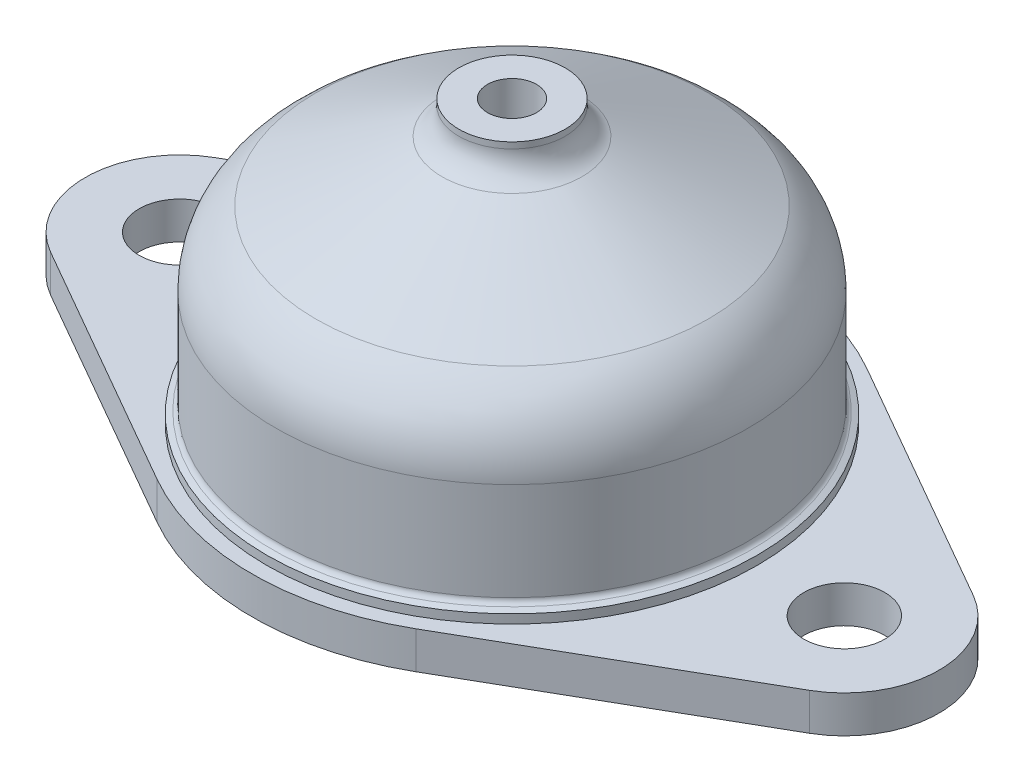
ISO-10303-21;
HEADER;
FILE_DESCRIPTION(('STEP AP214'),'2;1');
FILE_NAME('part.step','',(''),(''),'','','');
FILE_SCHEMA(('AUTOMOTIVE_DESIGN { 1 0 10303 214 1 1 1 1 }'));
ENDSEC;
DATA;
#1=APPLICATION_CONTEXT('core data for automotive mechanical design processes');
#2=APPLICATION_PROTOCOL_DEFINITION('international standard','automotive_design',2000,#1);
#3=PRODUCT_CONTEXT('',#1,'mechanical');
#4=PRODUCT('Part','Part','',(#3));
#5=PRODUCT_RELATED_PRODUCT_CATEGORY('part','',(#4));
#6=PRODUCT_DEFINITION_FORMATION('','',#4);
#7=PRODUCT_DEFINITION_CONTEXT('part definition',#1,'design');
#8=PRODUCT_DEFINITION('design','',#6,#7);
#9=PRODUCT_DEFINITION_SHAPE('','',#8);
#10=(LENGTH_UNIT() NAMED_UNIT(*) SI_UNIT(.MILLI.,.METRE.));
#11=(NAMED_UNIT(*) PLANE_ANGLE_UNIT() SI_UNIT($,.RADIAN.));
#12=(NAMED_UNIT(*) SI_UNIT($,.STERADIAN.) SOLID_ANGLE_UNIT());
#13=UNCERTAINTY_MEASURE_WITH_UNIT(LENGTH_MEASURE(1.E-05),#10,'distance_accuracy_value','');
#14=(GEOMETRIC_REPRESENTATION_CONTEXT(3) GLOBAL_UNCERTAINTY_ASSIGNED_CONTEXT((#13)) GLOBAL_UNIT_ASSIGNED_CONTEXT((#10,
#11,#12)) REPRESENTATION_CONTEXT('',''));
#15=CARTESIAN_POINT('',(0.,0.,0.));
#16=DIRECTION('',(0.,0.,1.));
#17=DIRECTION('',(1.,0.,0.));
#18=AXIS2_PLACEMENT_3D('',#15,#16,#17);
#19=CARTESIAN_POINT('',(0.,1.6002,0.));
#20=DIRECTION('',(0.,1.,0.));
#21=DIRECTION('',(0.,0.,1.));
#22=AXIS2_PLACEMENT_3D('',#19,#20,#21);
#23=PLANE('',#22);
#24=CARTESIAN_POINT('',(0.,1.6002,0.));
#25=DIRECTION('',(0.,1.,0.));
#26=DIRECTION('',(0.,0.,1.));
#27=AXIS2_PLACEMENT_3D('',#24,#25,#26);
#28=CIRCLE('',#27,10.541);
#29=CARTESIAN_POINT('',(0.,1.6002,10.541));
#30=VERTEX_POINT('',#29);
#31=EDGE_CURVE('E11',#30,#30,#28,.T.);
#32=ORIENTED_EDGE('',*,*,#31,.F.);
#33=EDGE_LOOP('',(#32));
#34=FACE_BOUND('',#33,.T.);
#35=CARTESIAN_POINT('',(14.2875,1.6002,0.));
#36=DIRECTION('',(0.,1.,0.));
#37=DIRECTION('',(0.,0.,1.));
#38=AXIS2_PLACEMENT_3D('',#35,#36,#37);
#39=CIRCLE('',#38,1.7399);
#40=CARTESIAN_POINT('',(14.2875,1.6002,1.7399));
#41=VERTEX_POINT('',#40);
#42=EDGE_CURVE('E651',#41,#41,#39,.T.);
#43=ORIENTED_EDGE('',*,*,#42,.F.);
#44=EDGE_LOOP('',(#43));
#45=FACE_BOUND('',#44,.T.);
#46=CARTESIAN_POINT('',(0.,1.6002,0.));
#47=DIRECTION('',(0.,1.,0.));
#48=DIRECTION('',(0.,0.,1.));
#49=AXIS2_PLACEMENT_3D('',#46,#47,#48);
#50=CIRCLE('',#49,11.176);
#51=CARTESIAN_POINT('',(5.56316444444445,1.6002,-9.69299630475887));
#52=VERTEX_POINT('',#51);
#53=CARTESIAN_POINT('',(-5.56316444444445,1.6002,-9.69299630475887));
#54=VERTEX_POINT('',#53);
#55=EDGE_CURVE('E453',#52,#54,#50,.T.);
#56=ORIENTED_EDGE('',*,*,#55,.T.);
#57=DIRECTION('',(-0.867304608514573,0.,0.497777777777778));
#58=VECTOR('',#57,1.);
#59=CARTESIAN_POINT('',(-16.3104688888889,1.6002,-3.52472592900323));
#60=LINE('',#59,#58);
#61=CARTESIAN_POINT('',(-16.3104688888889,1.6002,-3.52472592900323));
#62=VERTEX_POINT('',#61);
#63=EDGE_CURVE('E429',#54,#62,#60,.T.);
#64=ORIENTED_EDGE('',*,*,#63,.T.);
#65=CARTESIAN_POINT('',(-14.2875,1.6002,0.));
#66=DIRECTION('',(0.,1.,0.));
#67=DIRECTION('',(0.,0.,1.));
#68=AXIS2_PLACEMENT_3D('',#65,#66,#67);
#69=CIRCLE('',#68,4.064);
#70=CARTESIAN_POINT('',(-16.3104688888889,1.6002,3.52472592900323));
#71=VERTEX_POINT('',#70);
#72=EDGE_CURVE('E456',#62,#71,#69,.T.);
#73=ORIENTED_EDGE('',*,*,#72,.T.);
#74=DIRECTION('',(0.867304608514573,0.,0.497777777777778));
#75=VECTOR('',#74,1.);
#76=CARTESIAN_POINT('',(-16.3104688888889,1.6002,3.52472592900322));
#77=LINE('',#76,#75);
#78=CARTESIAN_POINT('',(-5.56316444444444,1.6002,9.69299630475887));
#79=VERTEX_POINT('',#78);
#80=EDGE_CURVE('E458',#71,#79,#77,.T.);
#81=ORIENTED_EDGE('',*,*,#80,.T.);
#82=CARTESIAN_POINT('',(0.,1.6002,0.));
#83=DIRECTION('',(0.,1.,0.));
#84=DIRECTION('',(0.,0.,1.));
#85=AXIS2_PLACEMENT_3D('',#82,#83,#84);
#86=CIRCLE('',#85,11.176);
#87=CARTESIAN_POINT('',(5.56316444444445,1.6002,9.69299630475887));
#88=VERTEX_POINT('',#87);
#89=EDGE_CURVE('E460',#79,#88,#86,.T.);
#90=ORIENTED_EDGE('',*,*,#89,.T.);
#91=DIRECTION('',(0.867304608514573,0.,-0.497777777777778));
#92=VECTOR('',#91,1.);
#93=CARTESIAN_POINT('',(5.56316444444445,1.6002,9.69299630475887));
#94=LINE('',#93,#92);
#95=CARTESIAN_POINT('',(16.3104688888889,1.6002,3.52472592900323));
#96=VERTEX_POINT('',#95);
#97=EDGE_CURVE('E462',#88,#96,#94,.T.);
#98=ORIENTED_EDGE('',*,*,#97,.T.);
#99=CARTESIAN_POINT('',(14.2875,1.6002,0.));
#100=DIRECTION('',(0.,1.,0.));
#101=DIRECTION('',(0.,0.,1.));
#102=AXIS2_PLACEMENT_3D('',#99,#100,#101);
#103=CIRCLE('',#102,4.064);
#104=CARTESIAN_POINT('',(16.3104688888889,1.6002,-3.52472592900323));
#105=VERTEX_POINT('',#104);
#106=EDGE_CURVE('E369',#96,#105,#103,.T.);
#107=ORIENTED_EDGE('',*,*,#106,.T.);
#108=DIRECTION('',(-0.867304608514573,0.,-0.497777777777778));
#109=VECTOR('',#108,1.);
#110=CARTESIAN_POINT('',(16.3104688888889,1.6002,-3.52472592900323));
#111=LINE('',#110,#109);
#112=EDGE_CURVE('E364',#105,#52,#111,.T.);
#113=ORIENTED_EDGE('',*,*,#112,.T.);
#114=EDGE_LOOP('',(#56,#64,#73,#81,#90,#98,#107,#113));
#115=FACE_BOUND('',#114,.T.);
#116=CARTESIAN_POINT('',(-14.2875,1.6002,0.));
#117=DIRECTION('',(0.,1.,0.));
#118=DIRECTION('',(0.,0.,1.));
#119=AXIS2_PLACEMENT_3D('',#116,#117,#118);
#120=CIRCLE('',#119,1.7399);
#121=CARTESIAN_POINT('',(-14.2875,1.6002,1.7399));
#122=VERTEX_POINT('',#121);
#123=EDGE_CURVE('E435',#122,#122,#120,.T.);
#124=ORIENTED_EDGE('',*,*,#123,.F.);
#125=EDGE_LOOP('',(#124));
#126=FACE_BOUND('',#125,.T.);
#127=ADVANCED_FACE('F349',(#34,#45,#115,#126),#23,.T.);
#128=CARTESIAN_POINT('',(0.,0.,0.));
#129=DIRECTION('',(0.,1.,0.));
#130=DIRECTION('',(0.,0.,1.));
#131=AXIS2_PLACEMENT_3D('',#128,#129,#130);
#132=PLANE('',#131);
#133=CARTESIAN_POINT('',(0.,0.,0.));
#134=DIRECTION('',(0.,-1.,0.));
#135=DIRECTION('',(0.,0.,-1.));
#136=AXIS2_PLACEMENT_3D('',#133,#134,#135);
#137=CIRCLE('',#136,8.42923824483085);
#138=CARTESIAN_POINT('',(0.,0.,-8.42923824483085));
#139=VERTEX_POINT('',#138);
#140=EDGE_CURVE('E603',#139,#139,#137,.T.);
#141=ORIENTED_EDGE('',*,*,#140,.F.);
#142=EDGE_LOOP('',(#141));
#143=FACE_BOUND('',#142,.T.);
#144=CARTESIAN_POINT('',(-14.2875,0.,0.));
#145=DIRECTION('',(0.,1.,0.));
#146=DIRECTION('',(0.,0.,1.));
#147=AXIS2_PLACEMENT_3D('',#144,#145,#146);
#148=CIRCLE('',#147,1.7399);
#149=CARTESIAN_POINT('',(-14.2875,0.,1.7399));
#150=VERTEX_POINT('',#149);
#151=EDGE_CURVE('E438',#150,#150,#148,.T.);
#152=ORIENTED_EDGE('',*,*,#151,.T.);
#153=EDGE_LOOP('',(#152));
#154=FACE_BOUND('',#153,.T.);
#155=CARTESIAN_POINT('',(0.,0.,0.));
#156=DIRECTION('',(0.,1.,0.));
#157=DIRECTION('',(0.,0.,1.));
#158=AXIS2_PLACEMENT_3D('',#155,#156,#157);
#159=CIRCLE('',#158,11.176);
#160=CARTESIAN_POINT('',(5.56316444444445,0.,-9.69299630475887));
#161=VERTEX_POINT('',#160);
#162=CARTESIAN_POINT('',(-5.56316444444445,0.,-9.69299630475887));
#163=VERTEX_POINT('',#162);
#164=EDGE_CURVE('E420',#161,#163,#159,.T.);
#165=ORIENTED_EDGE('',*,*,#164,.F.);
#166=DIRECTION('',(-0.867304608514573,0.,-0.497777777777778));
#167=VECTOR('',#166,1.);
#168=CARTESIAN_POINT('',(16.3104688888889,0.,-3.52472592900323));
#169=LINE('',#168,#167);
#170=CARTESIAN_POINT('',(16.3104688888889,0.,-3.52472592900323));
#171=VERTEX_POINT('',#170);
#172=EDGE_CURVE('E451',#171,#161,#169,.T.);
#173=ORIENTED_EDGE('',*,*,#172,.F.);
#174=CARTESIAN_POINT('',(14.2875,0.,0.));
#175=DIRECTION('',(0.,1.,0.));
#176=DIRECTION('',(0.,0.,1.));
#177=AXIS2_PLACEMENT_3D('',#174,#175,#176);
#178=CIRCLE('',#177,4.064);
#179=CARTESIAN_POINT('',(16.3104688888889,0.,3.52472592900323));
#180=VERTEX_POINT('',#179);
#181=EDGE_CURVE('E449',#180,#171,#178,.T.);
#182=ORIENTED_EDGE('',*,*,#181,.F.);
#183=DIRECTION('',(0.867304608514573,0.,-0.497777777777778));
#184=VECTOR('',#183,1.);
#185=CARTESIAN_POINT('',(5.56316444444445,0.,9.69299630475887));
#186=LINE('',#185,#184);
#187=CARTESIAN_POINT('',(5.56316444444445,0.,9.69299630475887));
#188=VERTEX_POINT('',#187);
#189=EDGE_CURVE('E447',#188,#180,#186,.T.);
#190=ORIENTED_EDGE('',*,*,#189,.F.);
#191=CARTESIAN_POINT('',(0.,0.,0.));
#192=DIRECTION('',(0.,1.,0.));
#193=DIRECTION('',(0.,0.,1.));
#194=AXIS2_PLACEMENT_3D('',#191,#192,#193);
#195=CIRCLE('',#194,11.176);
#196=CARTESIAN_POINT('',(-5.56316444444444,0.,9.69299630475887));
#197=VERTEX_POINT('',#196);
#198=EDGE_CURVE('E445',#197,#188,#195,.T.);
#199=ORIENTED_EDGE('',*,*,#198,.F.);
#200=DIRECTION('',(0.867304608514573,0.,0.497777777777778));
#201=VECTOR('',#200,1.);
#202=CARTESIAN_POINT('',(-16.3104688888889,0.,3.52472592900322));
#203=LINE('',#202,#201);
#204=CARTESIAN_POINT('',(-16.3104688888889,0.,3.52472592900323));
#205=VERTEX_POINT('',#204);
#206=EDGE_CURVE('E443',#205,#197,#203,.T.);
#207=ORIENTED_EDGE('',*,*,#206,.F.);
#208=CARTESIAN_POINT('',(-14.2875,0.,0.));
#209=DIRECTION('',(0.,1.,0.));
#210=DIRECTION('',(0.,0.,1.));
#211=AXIS2_PLACEMENT_3D('',#208,#209,#210);
#212=CIRCLE('',#211,4.064);
#213=CARTESIAN_POINT('',(-16.3104688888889,0.,-3.52472592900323));
#214=VERTEX_POINT('',#213);
#215=EDGE_CURVE('E422',#214,#205,#212,.T.);
#216=ORIENTED_EDGE('',*,*,#215,.F.);
#217=DIRECTION('',(-0.867304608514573,0.,0.497777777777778));
#218=VECTOR('',#217,1.);
#219=CARTESIAN_POINT('',(-16.3104688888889,0.,-3.52472592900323));
#220=LINE('',#219,#218);
#221=EDGE_CURVE('E414',#163,#214,#220,.T.);
#222=ORIENTED_EDGE('',*,*,#221,.F.);
#223=EDGE_LOOP('',(#165,#173,#182,#190,#199,#207,#216,#222));
#224=FACE_BOUND('',#223,.T.);
#225=CARTESIAN_POINT('',(14.2875,0.,0.));
#226=DIRECTION('',(0.,1.,0.));
#227=DIRECTION('',(0.,0.,1.));
#228=AXIS2_PLACEMENT_3D('',#225,#226,#227);
#229=CIRCLE('',#228,1.7399);
#230=CARTESIAN_POINT('',(14.2875,0.,1.7399));
#231=VERTEX_POINT('',#230);
#232=EDGE_CURVE('E648',#231,#231,#229,.T.);
#233=ORIENTED_EDGE('',*,*,#232,.T.);
#234=EDGE_LOOP('',(#233));
#235=FACE_BOUND('',#234,.T.);
#236=ADVANCED_FACE('F416',(#143,#154,#224,#235),#132,.F.);
#237=CARTESIAN_POINT('',(0.,1.6002,0.));
#238=DIRECTION('',(0.,-1.,0.));
#239=DIRECTION('',(0.,0.,-1.));
#240=AXIS2_PLACEMENT_3D('',#237,#238,#239);
#241=CYLINDRICAL_SURFACE('',#240,11.176);
#242=ORIENTED_EDGE('',*,*,#164,.T.);
#243=DIRECTION('',(0.,-1.,0.));
#244=VECTOR('',#243,1.);
#245=CARTESIAN_POINT('',(-5.56316444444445,1.6002,-9.69299630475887));
#246=LINE('',#245,#244);
#247=EDGE_CURVE('E357',#54,#163,#246,.T.);
#248=ORIENTED_EDGE('',*,*,#247,.F.);
#249=ORIENTED_EDGE('',*,*,#55,.F.);
#250=DIRECTION('',(0.,-1.,0.));
#251=VECTOR('',#250,1.);
#252=CARTESIAN_POINT('',(5.56316444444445,1.6002,-9.69299630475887));
#253=LINE('',#252,#251);
#254=EDGE_CURVE('E434',#52,#161,#253,.T.);
#255=ORIENTED_EDGE('',*,*,#254,.T.);
#256=EDGE_LOOP('',(#242,#248,#249,#255));
#257=FACE_BOUND('',#256,.T.);
#258=ADVANCED_FACE('F351',(#257),#241,.T.);
#259=CARTESIAN_POINT('',(-16.3104688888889,1.6002,-3.52472592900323));
#260=DIRECTION('',(0.497777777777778,0.,0.867304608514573));
#261=DIRECTION('',(0.867304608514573,0.,-0.497777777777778));
#262=AXIS2_PLACEMENT_3D('',#259,#260,#261);
#263=PLANE('',#262);
#264=ORIENTED_EDGE('',*,*,#221,.T.);
#265=DIRECTION('',(0.,-1.,0.));
#266=VECTOR('',#265,1.);
#267=CARTESIAN_POINT('',(-16.3104688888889,1.6002,-3.52472592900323));
#268=LINE('',#267,#266);
#269=EDGE_CURVE('E432',#62,#214,#268,.T.);
#270=ORIENTED_EDGE('',*,*,#269,.F.);
#271=ORIENTED_EDGE('',*,*,#63,.F.);
#272=ORIENTED_EDGE('',*,*,#247,.T.);
#273=EDGE_LOOP('',(#264,#270,#271,#272));
#274=FACE_BOUND('',#273,.T.);
#275=ADVANCED_FACE('F428',(#274),#263,.F.);
#276=CARTESIAN_POINT('',(-14.2875,1.6002,0.));
#277=DIRECTION('',(0.,-1.,0.));
#278=DIRECTION('',(0.,0.,-1.));
#279=AXIS2_PLACEMENT_3D('',#276,#277,#278);
#280=CYLINDRICAL_SURFACE('',#279,4.064);
#281=ORIENTED_EDGE('',*,*,#215,.T.);
#282=DIRECTION('',(0.,-1.,0.));
#283=VECTOR('',#282,1.);
#284=CARTESIAN_POINT('',(-16.3104688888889,1.6002,3.52472592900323));
#285=LINE('',#284,#283);
#286=EDGE_CURVE('E479',#71,#205,#285,.T.);
#287=ORIENTED_EDGE('',*,*,#286,.F.);
#288=ORIENTED_EDGE('',*,*,#72,.F.);
#289=ORIENTED_EDGE('',*,*,#269,.T.);
#290=EDGE_LOOP('',(#281,#287,#288,#289));
#291=FACE_BOUND('',#290,.T.);
#292=ADVANCED_FACE('F484',(#291),#280,.T.);
#293=CARTESIAN_POINT('',(-16.3104688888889,1.6002,3.52472592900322));
#294=DIRECTION('',(0.497777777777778,0.,-0.867304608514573));
#295=DIRECTION('',(-0.867304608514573,0.,-0.497777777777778));
#296=AXIS2_PLACEMENT_3D('',#293,#294,#295);
#297=PLANE('',#296);
#298=ORIENTED_EDGE('',*,*,#206,.T.);
#299=DIRECTION('',(0.,-1.,0.));
#300=VECTOR('',#299,1.);
#301=CARTESIAN_POINT('',(-5.56316444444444,1.6002,9.69299630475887));
#302=LINE('',#301,#300);
#303=EDGE_CURVE('E476',#79,#197,#302,.T.);
#304=ORIENTED_EDGE('',*,*,#303,.F.);
#305=ORIENTED_EDGE('',*,*,#80,.F.);
#306=ORIENTED_EDGE('',*,*,#286,.T.);
#307=EDGE_LOOP('',(#298,#304,#305,#306));
#308=FACE_BOUND('',#307,.T.);
#309=ADVANCED_FACE('F492',(#308),#297,.F.);
#310=CARTESIAN_POINT('',(0.,1.6002,0.));
#311=DIRECTION('',(0.,-1.,0.));
#312=DIRECTION('',(0.,0.,-1.));
#313=AXIS2_PLACEMENT_3D('',#310,#311,#312);
#314=CYLINDRICAL_SURFACE('',#313,11.176);
#315=ORIENTED_EDGE('',*,*,#198,.T.);
#316=DIRECTION('',(0.,-1.,0.));
#317=VECTOR('',#316,1.);
#318=CARTESIAN_POINT('',(5.56316444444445,1.6002,9.69299630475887));
#319=LINE('',#318,#317);
#320=EDGE_CURVE('E473',#88,#188,#319,.T.);
#321=ORIENTED_EDGE('',*,*,#320,.F.);
#322=ORIENTED_EDGE('',*,*,#89,.F.);
#323=ORIENTED_EDGE('',*,*,#303,.T.);
#324=EDGE_LOOP('',(#315,#321,#322,#323));
#325=FACE_BOUND('',#324,.T.);
#326=ADVANCED_FACE('F495',(#325),#314,.T.);
#327=CARTESIAN_POINT('',(5.56316444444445,1.6002,9.69299630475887));
#328=DIRECTION('',(-0.497777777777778,0.,-0.867304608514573));
#329=DIRECTION('',(-0.867304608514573,0.,0.497777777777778));
#330=AXIS2_PLACEMENT_3D('',#327,#328,#329);
#331=PLANE('',#330);
#332=ORIENTED_EDGE('',*,*,#189,.T.);
#333=DIRECTION('',(0.,-1.,0.));
#334=VECTOR('',#333,1.);
#335=CARTESIAN_POINT('',(16.3104688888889,1.6002,3.52472592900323));
#336=LINE('',#335,#334);
#337=EDGE_CURVE('E470',#96,#180,#336,.T.);
#338=ORIENTED_EDGE('',*,*,#337,.F.);
#339=ORIENTED_EDGE('',*,*,#97,.F.);
#340=ORIENTED_EDGE('',*,*,#320,.T.);
#341=EDGE_LOOP('',(#332,#338,#339,#340));
#342=FACE_BOUND('',#341,.T.);
#343=ADVANCED_FACE('F500',(#342),#331,.F.);
#344=CARTESIAN_POINT('',(14.2875,1.6002,0.));
#345=DIRECTION('',(0.,-1.,0.));
#346=DIRECTION('',(0.,0.,-1.));
#347=AXIS2_PLACEMENT_3D('',#344,#345,#346);
#348=CYLINDRICAL_SURFACE('',#347,4.064);
#349=ORIENTED_EDGE('',*,*,#181,.T.);
#350=DIRECTION('',(0.,-1.,0.));
#351=VECTOR('',#350,1.);
#352=CARTESIAN_POINT('',(16.3104688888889,1.6002,-3.52472592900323));
#353=LINE('',#352,#351);
#354=EDGE_CURVE('E467',#105,#171,#353,.T.);
#355=ORIENTED_EDGE('',*,*,#354,.F.);
#356=ORIENTED_EDGE('',*,*,#106,.F.);
#357=ORIENTED_EDGE('',*,*,#337,.T.);
#358=EDGE_LOOP('',(#349,#355,#356,#357));
#359=FACE_BOUND('',#358,.T.);
#360=ADVANCED_FACE('F503',(#359),#348,.T.);
#361=CARTESIAN_POINT('',(16.3104688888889,1.6002,-3.52472592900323));
#362=DIRECTION('',(-0.497777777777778,0.,0.867304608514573));
#363=DIRECTION('',(0.867304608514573,0.,0.497777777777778));
#364=AXIS2_PLACEMENT_3D('',#361,#362,#363);
#365=PLANE('',#364);
#366=ORIENTED_EDGE('',*,*,#172,.T.);
#367=ORIENTED_EDGE('',*,*,#254,.F.);
#368=ORIENTED_EDGE('',*,*,#112,.F.);
#369=ORIENTED_EDGE('',*,*,#354,.T.);
#370=EDGE_LOOP('',(#366,#367,#368,#369));
#371=FACE_BOUND('',#370,.T.);
#372=ADVANCED_FACE('F505',(#371),#365,.F.);
#373=CARTESIAN_POINT('',(-14.2875,1.6002,0.));
#374=DIRECTION('',(0.,-1.,0.));
#375=DIRECTION('',(0.,0.,-1.));
#376=AXIS2_PLACEMENT_3D('',#373,#374,#375);
#377=CYLINDRICAL_SURFACE('',#376,1.7399);
#378=ORIENTED_EDGE('',*,*,#123,.T.);
#379=EDGE_LOOP('',(#378));
#380=FACE_BOUND('',#379,.T.);
#381=ORIENTED_EDGE('',*,*,#151,.F.);
#382=EDGE_LOOP('',(#381));
#383=FACE_BOUND('',#382,.T.);
#384=ADVANCED_FACE('F507',(#380,#383),#377,.F.);
#385=CARTESIAN_POINT('',(14.2875,1.6002,0.));
#386=DIRECTION('',(0.,-1.,0.));
#387=DIRECTION('',(0.,0.,-1.));
#388=AXIS2_PLACEMENT_3D('',#385,#386,#387);
#389=CYLINDRICAL_SURFACE('',#388,1.7399);
#390=ORIENTED_EDGE('',*,*,#42,.T.);
#391=EDGE_LOOP('',(#390));
#392=FACE_BOUND('',#391,.T.);
#393=ORIENTED_EDGE('',*,*,#232,.F.);
#394=EDGE_LOOP('',(#393));
#395=FACE_BOUND('',#394,.T.);
#396=ADVANCED_FACE('F513',(#392,#395),#389,.F.);
#397=CARTESIAN_POINT('',(0.,-0.202291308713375,0.));
#398=DIRECTION('',(0.,-1.,0.));
#399=DIRECTION('',(0.,0.,-1.));
#400=AXIS2_PLACEMENT_3D('',#397,#398,#399);
#401=CYLINDRICAL_SURFACE('',#400,1.0541);
#402=CARTESIAN_POINT('',(0.,8.128,0.));
#403=DIRECTION('',(0.,-1.,0.));
#404=DIRECTION('',(0.,0.,-1.));
#405=AXIS2_PLACEMENT_3D('',#402,#403,#404);
#406=CIRCLE('',#405,1.0541);
#407=CARTESIAN_POINT('',(0.,8.128,-1.0541));
#408=VERTEX_POINT('',#407);
#409=EDGE_CURVE('E605',#408,#408,#406,.T.);
#410=ORIENTED_EDGE('',*,*,#409,.T.);
#411=EDGE_LOOP('',(#410));
#412=FACE_BOUND('',#411,.T.);
#413=CARTESIAN_POINT('',(0.,13.716,0.));
#414=DIRECTION('',(0.,-1.,0.));
#415=DIRECTION('',(0.,0.,-1.));
#416=AXIS2_PLACEMENT_3D('',#413,#414,#415);
#417=CIRCLE('',#416,1.0541);
#418=CARTESIAN_POINT('',(0.,13.716,-1.0541));
#419=VERTEX_POINT('',#418);
#420=EDGE_CURVE('E645',#419,#419,#417,.T.);
#421=ORIENTED_EDGE('',*,*,#420,.F.);
#422=EDGE_LOOP('',(#421));
#423=FACE_BOUND('',#422,.T.);
#424=ADVANCED_FACE('F530',(#412,#423),#401,.F.);
#425=CARTESIAN_POINT('',(1.0541,13.716,0.));
#426=DIRECTION('',(0.,1.,0.));
#427=DIRECTION('',(0.,0.,1.));
#428=AXIS2_PLACEMENT_3D('',#425,#426,#427);
#429=PLANE('',#428);
#430=ORIENTED_EDGE('',*,*,#420,.T.);
#431=EDGE_LOOP('',(#430));
#432=FACE_BOUND('',#431,.T.);
#433=CARTESIAN_POINT('',(0.,13.716,0.));
#434=DIRECTION('',(0.,-1.,0.));
#435=DIRECTION('',(0.,0.,-1.));
#436=AXIS2_PLACEMENT_3D('',#433,#434,#435);
#437=CIRCLE('',#436,2.286);
#438=CARTESIAN_POINT('',(0.,13.716,-2.286));
#439=VERTEX_POINT('',#438);
#440=EDGE_CURVE('E642',#439,#439,#437,.T.);
#441=ORIENTED_EDGE('',*,*,#440,.F.);
#442=EDGE_LOOP('',(#441));
#443=FACE_BOUND('',#442,.T.);
#444=ADVANCED_FACE('F534',(#432,#443),#429,.T.);
#445=CARTESIAN_POINT('',(0.,-0.202291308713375,0.));
#446=DIRECTION('',(0.,-1.,0.));
#447=DIRECTION('',(0.,0.,-1.));
#448=AXIS2_PLACEMENT_3D('',#445,#446,#447);
#449=CYLINDRICAL_SURFACE('',#448,2.286);
#450=ORIENTED_EDGE('',*,*,#440,.T.);
#451=EDGE_LOOP('',(#450));
#452=FACE_BOUND('',#451,.T.);
#453=CARTESIAN_POINT('',(0.,13.4519932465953,0.));
#454=DIRECTION('',(0.,-1.,0.));
#455=DIRECTION('',(0.,0.,-1.));
#456=AXIS2_PLACEMENT_3D('',#453,#454,#455);
#457=CIRCLE('',#456,2.286);
#458=CARTESIAN_POINT('',(0.,13.4519932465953,-2.286));
#459=VERTEX_POINT('',#458);
#460=EDGE_CURVE('E639',#459,#459,#457,.T.);
#461=ORIENTED_EDGE('',*,*,#460,.F.);
#462=EDGE_LOOP('',(#461));
#463=FACE_BOUND('',#462,.T.);
#464=ADVANCED_FACE('F538',(#452,#463),#449,.T.);
#465=CARTESIAN_POINT('',(0.,13.4519932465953,0.));
#466=DIRECTION('',(0.,-1.,0.));
#467=DIRECTION('',(0.,0.,-1.));
#468=AXIS2_PLACEMENT_3D('',#465,#466,#467);
#469=TOROIDAL_SURFACE('',#468,3.556,1.27);
#470=ORIENTED_EDGE('',*,*,#460,.T.);
#471=EDGE_LOOP('',(#470));
#472=FACE_BOUND('',#471,.T.);
#473=CARTESIAN_POINT('',(0.,12.306151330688,0.));
#474=DIRECTION('',(0.,-1.,0.));
#475=DIRECTION('',(0.,0.,-1.));
#476=AXIS2_PLACEMENT_3D('',#473,#474,#475);
#477=CIRCLE('',#476,3.00832646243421);
#478=CARTESIAN_POINT('',(0.,12.306151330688,-3.00832646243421));
#479=VERTEX_POINT('',#478);
#480=EDGE_CURVE('E636',#479,#479,#477,.T.);
#481=ORIENTED_EDGE('',*,*,#480,.F.);
#482=EDGE_LOOP('',(#481));
#483=FACE_BOUND('',#482,.T.);
#484=ADVANCED_FACE('F542',(#472,#483),#469,.F.);
#485=CARTESIAN_POINT('',(0.,9.71513952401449,0.));
#486=DIRECTION('',(0.,-1.,0.));
#487=DIRECTION('',(0.,0.,-1.));
#488=AXIS2_PLACEMENT_3D('',#485,#486,#487);
#489=CONICAL_SURFACE('',#488,8.42923824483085,1.12493074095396);
#490=ORIENTED_EDGE('',*,*,#480,.T.);
#491=EDGE_LOOP('',(#490));
#492=FACE_BOUND('',#491,.T.);
#493=CARTESIAN_POINT('',(0.,9.71513952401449,0.));
#494=DIRECTION('',(0.,-1.,0.));
#495=DIRECTION('',(0.,0.,-1.));
#496=AXIS2_PLACEMENT_3D('',#493,#494,#495);
#497=CIRCLE('',#496,8.42923824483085);
#498=CARTESIAN_POINT('',(0.,9.71513952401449,-8.42923824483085));
#499=VERTEX_POINT('',#498);
#500=EDGE_CURVE('E633',#499,#499,#497,.T.);
#501=ORIENTED_EDGE('',*,*,#500,.F.);
#502=EDGE_LOOP('',(#501));
#503=FACE_BOUND('',#502,.T.);
#504=ADVANCED_FACE('F546',(#492,#503),#489,.T.);
#505=CARTESIAN_POINT('',(0.,6.52251234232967,0.));
#506=DIRECTION('',(0.,-1.,0.));
#507=DIRECTION('',(0.,0.,-1.));
#508=AXIS2_PLACEMENT_3D('',#505,#506,#507);
#509=TOROIDAL_SURFACE('',#508,6.35,3.81);
#510=ORIENTED_EDGE('',*,*,#500,.T.);
#511=EDGE_LOOP('',(#510));
#512=FACE_BOUND('',#511,.T.);
#513=CARTESIAN_POINT('',(0.,6.52251234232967,0.));
#514=DIRECTION('',(0.,-1.,0.));
#515=DIRECTION('',(0.,0.,-1.));
#516=AXIS2_PLACEMENT_3D('',#513,#514,#515);
#517=CIRCLE('',#516,10.16);
#518=CARTESIAN_POINT('',(0.,6.52251234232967,-10.16));
#519=VERTEX_POINT('',#518);
#520=EDGE_CURVE('E630',#519,#519,#517,.T.);
#521=ORIENTED_EDGE('',*,*,#520,.F.);
#522=EDGE_LOOP('',(#521));
#523=FACE_BOUND('',#522,.T.);
#524=ADVANCED_FACE('F550',(#512,#523),#509,.T.);
#525=CARTESIAN_POINT('',(0.,-0.202291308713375,0.));
#526=DIRECTION('',(0.,-1.,0.));
#527=DIRECTION('',(0.,0.,-1.));
#528=AXIS2_PLACEMENT_3D('',#525,#526,#527);
#529=CYLINDRICAL_SURFACE('',#528,10.16);
#530=ORIENTED_EDGE('',*,*,#520,.T.);
#531=EDGE_LOOP('',(#530));
#532=FACE_BOUND('',#531,.T.);
#533=CARTESIAN_POINT('',(0.,2.31402642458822,0.));
#534=DIRECTION('',(0.,-1.,0.));
#535=DIRECTION('',(0.,0.,-1.));
#536=AXIS2_PLACEMENT_3D('',#533,#534,#535);
#537=CIRCLE('',#536,10.16);
#538=CARTESIAN_POINT('',(0.,2.31402642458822,-10.16));
#539=VERTEX_POINT('',#538);
#540=EDGE_CURVE('E627',#539,#539,#537,.T.);
#541=ORIENTED_EDGE('',*,*,#540,.F.);
#542=EDGE_LOOP('',(#541));
#543=FACE_BOUND('',#542,.T.);
#544=ADVANCED_FACE('F554',(#532,#543),#529,.T.);
#545=CARTESIAN_POINT('',(0.,2.31402642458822,0.));
#546=DIRECTION('',(0.,-1.,0.));
#547=DIRECTION('',(0.,0.,-1.));
#548=AXIS2_PLACEMENT_3D('',#545,#546,#547);
#549=TOROIDAL_SURFACE('',#548,10.414,0.254000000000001);
#550=ORIENTED_EDGE('',*,*,#540,.T.);
#551=EDGE_LOOP('',(#550));
#552=FACE_BOUND('',#551,.T.);
#553=CARTESIAN_POINT('',(0.,2.08132954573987,0.));
#554=DIRECTION('',(0.,-1.,0.));
#555=DIRECTION('',(0.,0.,-1.));
#556=AXIS2_PLACEMENT_3D('',#553,#554,#555);
#557=CIRCLE('',#556,10.3121758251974);
#558=CARTESIAN_POINT('',(0.,2.08132954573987,-10.3121758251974));
#559=VERTEX_POINT('',#558);
#560=EDGE_CURVE('E624',#559,#559,#557,.T.);
#561=ORIENTED_EDGE('',*,*,#560,.F.);
#562=EDGE_LOOP('',(#561));
#563=FACE_BOUND('',#562,.T.);
#564=ADVANCED_FACE('F558',(#552,#563),#549,.F.);
#565=CARTESIAN_POINT('',(0.,1.9812,0.));
#566=DIRECTION('',(0.,-1.,0.));
#567=DIRECTION('',(0.,0.,-1.));
#568=AXIS2_PLACEMENT_3D('',#565,#566,#567);
#569=CONICAL_SURFACE('',#568,10.541,1.15831630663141);
#570=ORIENTED_EDGE('',*,*,#560,.T.);
#571=EDGE_LOOP('',(#570));
#572=FACE_BOUND('',#571,.T.);
#573=CARTESIAN_POINT('',(0.,1.9812,0.));
#574=DIRECTION('',(0.,-1.,0.));
#575=DIRECTION('',(0.,0.,-1.));
#576=AXIS2_PLACEMENT_3D('',#573,#574,#575);
#577=CIRCLE('',#576,10.541);
#578=CARTESIAN_POINT('',(0.,1.9812,-10.541));
#579=VERTEX_POINT('',#578);
#580=EDGE_CURVE('E621',#579,#579,#577,.T.);
#581=ORIENTED_EDGE('',*,*,#580,.F.);
#582=EDGE_LOOP('',(#581));
#583=FACE_BOUND('',#582,.T.);
#584=ADVANCED_FACE('F562',(#572,#583),#569,.T.);
#585=CARTESIAN_POINT('',(0.,-0.202291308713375,0.));
#586=DIRECTION('',(0.,-1.,0.));
#587=DIRECTION('',(0.,0.,-1.));
#588=AXIS2_PLACEMENT_3D('',#585,#586,#587);
#589=CYLINDRICAL_SURFACE('',#588,10.541);
#590=ORIENTED_EDGE('',*,*,#580,.T.);
#591=EDGE_LOOP('',(#590));
#592=FACE_BOUND('',#591,.T.);
#593=ORIENTED_EDGE('',*,*,#31,.T.);
#594=EDGE_LOOP('',(#593));
#595=FACE_BOUND('',#594,.T.);
#596=ADVANCED_FACE('F566',(#592,#595),#589,.T.);
#597=CARTESIAN_POINT('',(0.,-0.202291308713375,0.));
#598=DIRECTION('',(0.,-1.,0.));
#599=DIRECTION('',(0.,0.,-1.));
#600=AXIS2_PLACEMENT_3D('',#597,#598,#599);
#601=CYLINDRICAL_SURFACE('',#600,7.14791623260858);
#602=CARTESIAN_POINT('',(0.,1.6002,0.));
#603=DIRECTION('',(0.,-1.,0.));
#604=DIRECTION('',(0.,0.,-1.));
#605=AXIS2_PLACEMENT_3D('',#602,#603,#604);
#606=CIRCLE('',#605,7.14791623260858);
#607=CARTESIAN_POINT('',(0.,1.6002,-7.14791623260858));
#608=VERTEX_POINT('',#607);
#609=EDGE_CURVE('E599',#608,#608,#606,.T.);
#610=ORIENTED_EDGE('',*,*,#609,.T.);
#611=EDGE_LOOP('',(#610));
#612=FACE_BOUND('',#611,.T.);
#613=CARTESIAN_POINT('',(0.,3.86004471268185,0.));
#614=DIRECTION('',(0.,-1.,0.));
#615=DIRECTION('',(0.,0.,-1.));
#616=AXIS2_PLACEMENT_3D('',#613,#614,#615);
#617=CIRCLE('',#616,7.14791623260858);
#618=CARTESIAN_POINT('',(0.,3.86004471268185,-7.14791623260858));
#619=VERTEX_POINT('',#618);
#620=EDGE_CURVE('E618',#619,#619,#617,.T.);
#621=ORIENTED_EDGE('',*,*,#620,.F.);
#622=EDGE_LOOP('',(#621));
#623=FACE_BOUND('',#622,.T.);
#624=ADVANCED_FACE('F570',(#612,#623),#601,.F.);
#625=CARTESIAN_POINT('',(0.,3.86004471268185,0.));
#626=DIRECTION('',(0.,-1.,0.));
#627=DIRECTION('',(0.,0.,-1.));
#628=AXIS2_PLACEMENT_3D('',#625,#626,#627);
#629=TOROIDAL_SURFACE('',#628,5.11591623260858,2.032);
#630=ORIENTED_EDGE('',*,*,#620,.T.);
#631=EDGE_LOOP('',(#630));
#632=FACE_BOUND('',#631,.T.);
#633=CARTESIAN_POINT('',(0.,5.56277920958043,0.));
#634=DIRECTION('',(0.,-1.,0.));
#635=DIRECTION('',(0.,0.,-1.));
#636=AXIS2_PLACEMENT_3D('',#633,#634,#635);
#637=CIRCLE('',#636,6.22484329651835);
#638=CARTESIAN_POINT('',(0.,5.56277920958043,-6.22484329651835));
#639=VERTEX_POINT('',#638);
#640=EDGE_CURVE('E615',#639,#639,#637,.T.);
#641=ORIENTED_EDGE('',*,*,#640,.F.);
#642=EDGE_LOOP('',(#641));
#643=FACE_BOUND('',#642,.T.);
#644=ADVANCED_FACE('F574',(#632,#643),#629,.F.);
#645=CARTESIAN_POINT('',(0.,8.128,0.));
#646=DIRECTION('',(0.,-1.,0.));
#647=DIRECTION('',(0.,0.,-1.));
#648=AXIS2_PLACEMENT_3D('',#645,#646,#647);
#649=CONICAL_SURFACE('',#648,2.286,0.993534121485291);
#650=ORIENTED_EDGE('',*,*,#640,.T.);
#651=EDGE_LOOP('',(#650));
#652=FACE_BOUND('',#651,.T.);
#653=CARTESIAN_POINT('',(0.,8.128,0.));
#654=DIRECTION('',(0.,-1.,0.));
#655=DIRECTION('',(0.,0.,-1.));
#656=AXIS2_PLACEMENT_3D('',#653,#654,#655);
#657=CIRCLE('',#656,2.286);
#658=CARTESIAN_POINT('',(0.,8.128,-2.286));
#659=VERTEX_POINT('',#658);
#660=EDGE_CURVE('E612',#659,#659,#657,.T.);
#661=ORIENTED_EDGE('',*,*,#660,.F.);
#662=EDGE_LOOP('',(#661));
#663=FACE_BOUND('',#662,.T.);
#664=ADVANCED_FACE('F578',(#652,#663),#649,.F.);
#665=CARTESIAN_POINT('',(1.0541,8.128,0.));
#666=DIRECTION('',(0.,-1.,0.));
#667=DIRECTION('',(0.,0.,-1.));
#668=AXIS2_PLACEMENT_3D('',#665,#666,#667);
#669=PLANE('',#668);
#670=ORIENTED_EDGE('',*,*,#660,.T.);
#671=EDGE_LOOP('',(#670));
#672=FACE_BOUND('',#671,.T.);
#673=ORIENTED_EDGE('',*,*,#409,.F.);
#674=EDGE_LOOP('',(#673));
#675=FACE_BOUND('',#674,.T.);
#676=ADVANCED_FACE('F582',(#672,#675),#669,.T.);
#677=CARTESIAN_POINT('',(0.,1.6002,0.));
#678=DIRECTION('',(0.,-1.,0.));
#679=DIRECTION('',(0.,0.,-1.));
#680=AXIS2_PLACEMENT_3D('',#677,#678,#679);
#681=CYLINDRICAL_SURFACE('',#680,8.42923824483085);
#682=CARTESIAN_POINT('',(0.,1.6002,0.));
#683=DIRECTION('',(0.,-1.,0.));
#684=DIRECTION('',(0.,0.,-1.));
#685=AXIS2_PLACEMENT_3D('',#682,#683,#684);
#686=CIRCLE('',#685,8.42923824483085);
#687=CARTESIAN_POINT('',(0.,1.6002,-8.42923824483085));
#688=VERTEX_POINT('',#687);
#689=EDGE_CURVE('E602',#688,#688,#686,.T.);
#690=ORIENTED_EDGE('',*,*,#689,.F.);
#691=EDGE_LOOP('',(#690));
#692=FACE_BOUND('',#691,.T.);
#693=ORIENTED_EDGE('',*,*,#140,.T.);
#694=EDGE_LOOP('',(#693));
#695=FACE_BOUND('',#694,.T.);
#696=ADVANCED_FACE('F586',(#692,#695),#681,.F.);
#697=CARTESIAN_POINT('',(0.,1.6002,0.));
#698=DIRECTION('',(0.,-1.,0.));
#699=DIRECTION('',(0.,0.,-1.));
#700=AXIS2_PLACEMENT_3D('',#697,#698,#699);
#701=PLANE('',#700);
#702=ORIENTED_EDGE('',*,*,#609,.F.);
#703=EDGE_LOOP('',(#702));
#704=FACE_BOUND('',#703,.T.);
#705=ORIENTED_EDGE('',*,*,#689,.T.);
#706=EDGE_LOOP('',(#705));
#707=FACE_BOUND('',#706,.T.);
#708=ADVANCED_FACE('F590',(#704,#707),#701,.T.);
#709=CLOSED_SHELL('',(#127,#236,#258,#275,#292,#309,#326,#343,#360,#372,#384,#396,#424,#444,
#464,#484,#504,#524,#544,#564,#584,#596,#624,#644,#664,#676,#696,#708));
#710=MANIFOLD_SOLID_BREP('B2',#709);
#711=ADVANCED_BREP_SHAPE_REPRESENTATION('',(#18,#710),#14);
#712=SHAPE_DEFINITION_REPRESENTATION(#9,#711);
ENDSEC;
END-ISO-10303-21;
